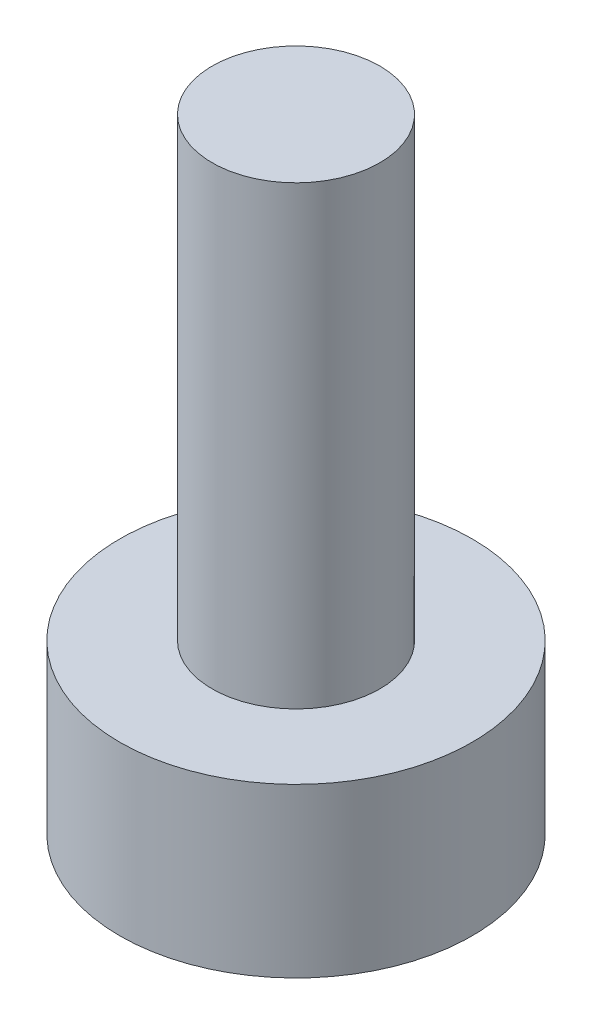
from build123d import *

# Parameters (mm, degrees)
SKETCH1_R      = 3.683
EXTRUDE1_DEPTH = 3.5052
SKETCH2_R      = 1.7526
EXTRUDE2_DEPTH = 9.525


with BuildPart() as part:
    # Sketch1 → Extrude1 (new body)
    with BuildSketch(Plane(origin=(0, 0, 0), x_dir=(1, 0, 0), z_dir=(0, 1, 0))):
        with Locations(Location((0, 0, 0), (0, 0, 270))):
            Circle(SKETCH1_R)
    extrude(amount=EXTRUDE1_DEPTH)

    # Sketch2 → Extrude2 (add)
    with BuildSketch(Plane(origin=(0, 3.5052, 0), x_dir=(-1, 0, 0), z_dir=(0, 1, 0))):
        with Locations(Location((0, 0, 0), (0, 0, 270))):
            Circle(SKETCH2_R)
    extrude(amount=EXTRUDE2_DEPTH)


solid = part.part
